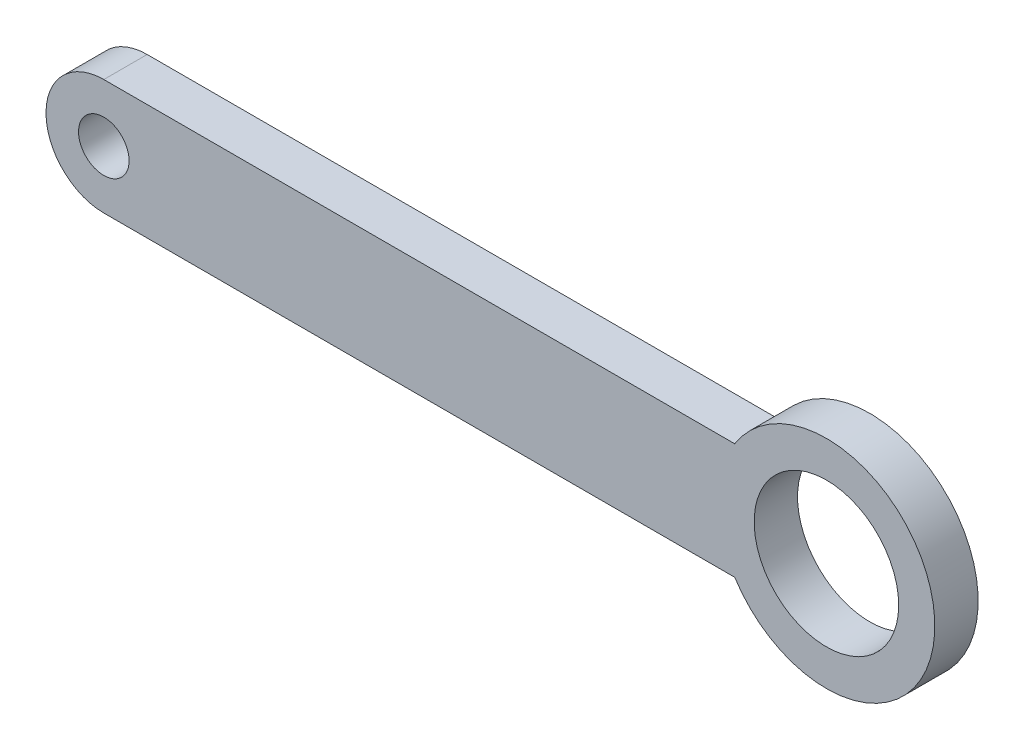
ISO-10303-21;
HEADER;
FILE_DESCRIPTION(('STEP AP214'),'2;1');
FILE_NAME('part.step','',(''),(''),'','','');
FILE_SCHEMA(('AUTOMOTIVE_DESIGN { 1 0 10303 214 1 1 1 1 }'));
ENDSEC;
DATA;
#1=APPLICATION_CONTEXT('core data for automotive mechanical design processes');
#2=APPLICATION_PROTOCOL_DEFINITION('international standard','automotive_design',2000,#1);
#3=PRODUCT_CONTEXT('',#1,'mechanical');
#4=PRODUCT('Part','Part','',(#3));
#5=PRODUCT_RELATED_PRODUCT_CATEGORY('part','',(#4));
#6=PRODUCT_DEFINITION_FORMATION('','',#4);
#7=PRODUCT_DEFINITION_CONTEXT('part definition',#1,'design');
#8=PRODUCT_DEFINITION('design','',#6,#7);
#9=PRODUCT_DEFINITION_SHAPE('','',#8);
#10=(LENGTH_UNIT() NAMED_UNIT(*) SI_UNIT(.MILLI.,.METRE.));
#11=(NAMED_UNIT(*) PLANE_ANGLE_UNIT() SI_UNIT($,.RADIAN.));
#12=(NAMED_UNIT(*) SI_UNIT($,.STERADIAN.) SOLID_ANGLE_UNIT());
#13=UNCERTAINTY_MEASURE_WITH_UNIT(LENGTH_MEASURE(1.E-05),#10,'distance_accuracy_value','');
#14=(GEOMETRIC_REPRESENTATION_CONTEXT(3) GLOBAL_UNCERTAINTY_ASSIGNED_CONTEXT((#13)) GLOBAL_UNIT_ASSIGNED_CONTEXT((#10,
#11,#12)) REPRESENTATION_CONTEXT('',''));
#15=CARTESIAN_POINT('',(0.,0.,0.));
#16=DIRECTION('',(0.,0.,1.));
#17=DIRECTION('',(1.,0.,0.));
#18=AXIS2_PLACEMENT_3D('',#15,#16,#17);
#19=CARTESIAN_POINT('',(0.,4.,3.));
#20=DIRECTION('',(0.,1.,0.));
#21=DIRECTION('',(0.,0.,1.));
#22=AXIS2_PLACEMENT_3D('',#19,#20,#21);
#23=PLANE('',#22);
#24=DIRECTION('',(1.,0.,0.));
#25=VECTOR('',#24,1.);
#26=CARTESIAN_POINT('',(0.,4.,0.));
#27=LINE('',#26,#25);
#28=CARTESIAN_POINT('',(-50.,4.,0.));
#29=VERTEX_POINT('',#28);
#30=CARTESIAN_POINT('',(-6.34428877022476,4.,0.));
#31=VERTEX_POINT('',#30);
#32=EDGE_CURVE('E105',#29,#31,#27,.T.);
#33=ORIENTED_EDGE('',*,*,#32,.F.);
#34=DIRECTION('',(0.,0.,-1.));
#35=VECTOR('',#34,1.);
#36=CARTESIAN_POINT('',(-50.,4.,3.));
#37=LINE('',#36,#35);
#38=CARTESIAN_POINT('',(-50.,4.,3.));
#39=VERTEX_POINT('',#38);
#40=EDGE_CURVE('E11',#39,#29,#37,.T.);
#41=ORIENTED_EDGE('',*,*,#40,.F.);
#42=DIRECTION('',(1.,0.,0.));
#43=VECTOR('',#42,1.);
#44=CARTESIAN_POINT('',(0.,4.,3.));
#45=LINE('',#44,#43);
#46=CARTESIAN_POINT('',(-6.34428877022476,4.,3.));
#47=VERTEX_POINT('',#46);
#48=EDGE_CURVE('E91',#39,#47,#45,.T.);
#49=ORIENTED_EDGE('',*,*,#48,.T.);
#50=DIRECTION('',(0.,0.,-1.));
#51=VECTOR('',#50,1.);
#52=CARTESIAN_POINT('',(-6.34428877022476,4.,3.));
#53=LINE('',#52,#51);
#54=EDGE_CURVE('E73',#47,#31,#53,.T.);
#55=ORIENTED_EDGE('',*,*,#54,.T.);
#56=EDGE_LOOP('',(#33,#41,#49,#55));
#57=FACE_BOUND('',#56,.T.);
#58=ADVANCED_FACE('F34',(#57),#23,.T.);
#59=CARTESIAN_POINT('',(-50.,0.,3.));
#60=DIRECTION('',(0.,0.,-1.));
#61=DIRECTION('',(-1.,0.,0.));
#62=AXIS2_PLACEMENT_3D('',#59,#60,#61);
#63=CYLINDRICAL_SURFACE('',#62,4.00000000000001);
#64=CARTESIAN_POINT('',(-50.,0.,0.));
#65=DIRECTION('',(0.,0.,1.));
#66=DIRECTION('',(1.,0.,0.));
#67=AXIS2_PLACEMENT_3D('',#64,#65,#66);
#68=CIRCLE('',#67,4.00000000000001);
#69=CARTESIAN_POINT('',(-50.,-4.00000000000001,0.));
#70=VERTEX_POINT('',#69);
#71=EDGE_CURVE('E96',#29,#70,#68,.T.);
#72=ORIENTED_EDGE('',*,*,#71,.T.);
#73=DIRECTION('',(0.,0.,-1.));
#74=VECTOR('',#73,1.);
#75=CARTESIAN_POINT('',(-50.,-4.00000000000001,3.));
#76=LINE('',#75,#74);
#77=CARTESIAN_POINT('',(-50.,-4.00000000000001,3.));
#78=VERTEX_POINT('',#77);
#79=EDGE_CURVE('E43',#78,#70,#76,.T.);
#80=ORIENTED_EDGE('',*,*,#79,.F.);
#81=CARTESIAN_POINT('',(-50.,0.,3.));
#82=DIRECTION('',(0.,0.,1.));
#83=DIRECTION('',(1.,0.,0.));
#84=AXIS2_PLACEMENT_3D('',#81,#82,#83);
#85=CIRCLE('',#84,4.00000000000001);
#86=EDGE_CURVE('E88',#39,#78,#85,.T.);
#87=ORIENTED_EDGE('',*,*,#86,.F.);
#88=ORIENTED_EDGE('',*,*,#40,.T.);
#89=EDGE_LOOP('',(#72,#80,#87,#88));
#90=FACE_BOUND('',#89,.T.);
#91=ADVANCED_FACE('F94',(#90),#63,.T.);
#92=CARTESIAN_POINT('',(0.,-4.00000000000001,3.));
#93=DIRECTION('',(0.,1.,0.));
#94=DIRECTION('',(0.,0.,1.));
#95=AXIS2_PLACEMENT_3D('',#92,#93,#94);
#96=PLANE('',#95);
#97=DIRECTION('',(1.,0.,0.));
#98=VECTOR('',#97,1.);
#99=CARTESIAN_POINT('',(0.,-4.00000000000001,0.));
#100=LINE('',#99,#98);
#101=CARTESIAN_POINT('',(-6.34428877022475,-4.00000000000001,0.));
#102=VERTEX_POINT('',#101);
#103=EDGE_CURVE('E102',#70,#102,#100,.T.);
#104=ORIENTED_EDGE('',*,*,#103,.T.);
#105=DIRECTION('',(0.,0.,-1.));
#106=VECTOR('',#105,1.);
#107=CARTESIAN_POINT('',(-6.34428877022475,-4.00000000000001,3.));
#108=LINE('',#107,#106);
#109=CARTESIAN_POINT('',(-6.34428877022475,-4.00000000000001,3.));
#110=VERTEX_POINT('',#109);
#111=EDGE_CURVE('E87',#110,#102,#108,.T.);
#112=ORIENTED_EDGE('',*,*,#111,.F.);
#113=DIRECTION('',(1.,0.,0.));
#114=VECTOR('',#113,1.);
#115=CARTESIAN_POINT('',(0.,-4.00000000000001,3.));
#116=LINE('',#115,#114);
#117=EDGE_CURVE('E81',#78,#110,#116,.T.);
#118=ORIENTED_EDGE('',*,*,#117,.F.);
#119=ORIENTED_EDGE('',*,*,#79,.T.);
#120=EDGE_LOOP('',(#104,#112,#118,#119));
#121=FACE_BOUND('',#120,.T.);
#122=ADVANCED_FACE('F84',(#121),#96,.F.);
#123=CARTESIAN_POINT('',(0.,0.,3.));
#124=DIRECTION('',(0.,0.,-1.));
#125=DIRECTION('',(-1.,0.,0.));
#126=AXIS2_PLACEMENT_3D('',#123,#124,#125);
#127=CYLINDRICAL_SURFACE('',#126,5.);
#128=CARTESIAN_POINT('',(0.,0.,3.));
#129=DIRECTION('',(0.,0.,1.));
#130=DIRECTION('',(1.,0.,0.));
#131=AXIS2_PLACEMENT_3D('',#128,#129,#130);
#132=CIRCLE('',#131,5.);
#133=CARTESIAN_POINT('',(5.,0.,3.));
#134=VERTEX_POINT('',#133);
#135=EDGE_CURVE('E115',#134,#134,#132,.T.);
#136=ORIENTED_EDGE('',*,*,#135,.T.);
#137=EDGE_LOOP('',(#136));
#138=FACE_BOUND('',#137,.T.);
#139=CARTESIAN_POINT('',(0.,0.,0.));
#140=DIRECTION('',(0.,0.,1.));
#141=DIRECTION('',(1.,0.,0.));
#142=AXIS2_PLACEMENT_3D('',#139,#140,#141);
#143=CIRCLE('',#142,5.);
#144=CARTESIAN_POINT('',(5.,0.,0.));
#145=VERTEX_POINT('',#144);
#146=EDGE_CURVE('E107',#145,#145,#143,.T.);
#147=ORIENTED_EDGE('',*,*,#146,.F.);
#148=EDGE_LOOP('',(#147));
#149=FACE_BOUND('',#148,.T.);
#150=ADVANCED_FACE('F130',(#138,#149),#127,.F.);
#151=CARTESIAN_POINT('',(-50.,0.,3.));
#152=DIRECTION('',(0.,0.,-1.));
#153=DIRECTION('',(-1.,0.,0.));
#154=AXIS2_PLACEMENT_3D('',#151,#152,#153);
#155=CYLINDRICAL_SURFACE('',#154,1.75);
#156=CARTESIAN_POINT('',(-50.,0.,3.));
#157=DIRECTION('',(0.,0.,1.));
#158=DIRECTION('',(1.,0.,0.));
#159=AXIS2_PLACEMENT_3D('',#156,#157,#158);
#160=CIRCLE('',#159,1.75);
#161=CARTESIAN_POINT('',(-48.25,0.,3.));
#162=VERTEX_POINT('',#161);
#163=EDGE_CURVE('E101',#162,#162,#160,.T.);
#164=ORIENTED_EDGE('',*,*,#163,.T.);
#165=EDGE_LOOP('',(#164));
#166=FACE_BOUND('',#165,.T.);
#167=CARTESIAN_POINT('',(-50.,0.,0.));
#168=DIRECTION('',(0.,0.,1.));
#169=DIRECTION('',(1.,0.,0.));
#170=AXIS2_PLACEMENT_3D('',#167,#168,#169);
#171=CIRCLE('',#170,1.75);
#172=CARTESIAN_POINT('',(-48.25,0.,0.));
#173=VERTEX_POINT('',#172);
#174=EDGE_CURVE('E110',#173,#173,#171,.T.);
#175=ORIENTED_EDGE('',*,*,#174,.F.);
#176=EDGE_LOOP('',(#175));
#177=FACE_BOUND('',#176,.T.);
#178=ADVANCED_FACE('F36',(#166,#177),#155,.F.);
#179=CARTESIAN_POINT('',(0.,0.,3.));
#180=DIRECTION('',(0.,0.,-1.));
#181=DIRECTION('',(-1.,0.,0.));
#182=AXIS2_PLACEMENT_3D('',#179,#180,#181);
#183=CYLINDRICAL_SURFACE('',#182,7.5);
#184=CARTESIAN_POINT('',(0.,0.,0.));
#185=DIRECTION('',(0.,0.,1.));
#186=DIRECTION('',(1.,0.,0.));
#187=AXIS2_PLACEMENT_3D('',#184,#185,#186);
#188=CIRCLE('',#187,7.5);
#189=EDGE_CURVE('E66',#102,#31,#188,.T.);
#190=ORIENTED_EDGE('',*,*,#189,.T.);
#191=ORIENTED_EDGE('',*,*,#54,.F.);
#192=CARTESIAN_POINT('',(0.,0.,3.));
#193=DIRECTION('',(0.,0.,1.));
#194=DIRECTION('',(1.,0.,0.));
#195=AXIS2_PLACEMENT_3D('',#192,#193,#194);
#196=CIRCLE('',#195,7.5);
#197=EDGE_CURVE('E51',#110,#47,#196,.T.);
#198=ORIENTED_EDGE('',*,*,#197,.F.);
#199=ORIENTED_EDGE('',*,*,#111,.T.);
#200=EDGE_LOOP('',(#190,#191,#198,#199));
#201=FACE_BOUND('',#200,.T.);
#202=ADVANCED_FACE('F126',(#201),#183,.T.);
#203=CARTESIAN_POINT('',(0.,0.,3.));
#204=DIRECTION('',(0.,0.,1.));
#205=DIRECTION('',(1.,0.,0.));
#206=AXIS2_PLACEMENT_3D('',#203,#204,#205);
#207=PLANE('',#206);
#208=ORIENTED_EDGE('',*,*,#163,.F.);
#209=EDGE_LOOP('',(#208));
#210=FACE_BOUND('',#209,.T.);
#211=ORIENTED_EDGE('',*,*,#135,.F.);
#212=EDGE_LOOP('',(#211));
#213=FACE_BOUND('',#212,.T.);
#214=ORIENTED_EDGE('',*,*,#48,.F.);
#215=ORIENTED_EDGE('',*,*,#86,.T.);
#216=ORIENTED_EDGE('',*,*,#117,.T.);
#217=ORIENTED_EDGE('',*,*,#197,.T.);
#218=EDGE_LOOP('',(#214,#215,#216,#217));
#219=FACE_BOUND('',#218,.T.);
#220=ADVANCED_FACE('F90',(#210,#213,#219),#207,.T.);
#221=CARTESIAN_POINT('',(0.,0.,0.));
#222=DIRECTION('',(0.,0.,1.));
#223=DIRECTION('',(1.,0.,0.));
#224=AXIS2_PLACEMENT_3D('',#221,#222,#223);
#225=PLANE('',#224);
#226=ORIENTED_EDGE('',*,*,#174,.T.);
#227=EDGE_LOOP('',(#226));
#228=FACE_BOUND('',#227,.T.);
#229=ORIENTED_EDGE('',*,*,#146,.T.);
#230=EDGE_LOOP('',(#229));
#231=FACE_BOUND('',#230,.T.);
#232=ORIENTED_EDGE('',*,*,#32,.T.);
#233=ORIENTED_EDGE('',*,*,#189,.F.);
#234=ORIENTED_EDGE('',*,*,#103,.F.);
#235=ORIENTED_EDGE('',*,*,#71,.F.);
#236=EDGE_LOOP('',(#232,#233,#234,#235));
#237=FACE_BOUND('',#236,.T.);
#238=ADVANCED_FACE('F125',(#228,#231,#237),#225,.F.);
#239=CLOSED_SHELL('',(#58,#91,#122,#150,#178,#202,#220,#238));
#240=MANIFOLD_SOLID_BREP('B2',#239);
#241=ADVANCED_BREP_SHAPE_REPRESENTATION('',(#18,#240),#14);
#242=SHAPE_DEFINITION_REPRESENTATION(#9,#241);
ENDSEC;
END-ISO-10303-21;
